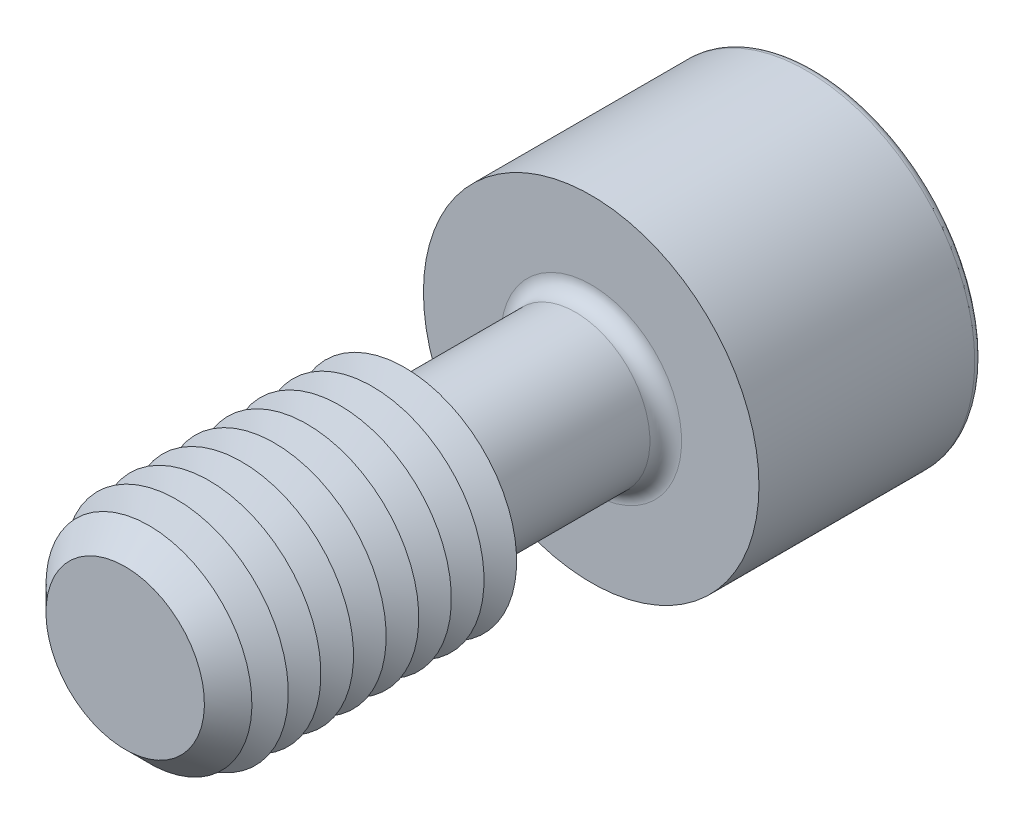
from build123d import *

# Parameters (mm, degrees)
SKETCH1_R       = 4
EXTRUDE1_DEPTH  = 12.5
CHAMFER1_SIZE   = 1.75
SKETCH3_R       = 9
EXTRUDE2_DEPTH  = 12
EXTRUDE3_DEPTH  = 10
FILLET1_R       = 0.85
FILLET2_R       = 0.425
LPATTERN1_COUNT = 8
LPATTERN1_PITCH = 1.75


with BuildPart() as part:
    # Sketch1 → Extrude1 (new, symmetric)
    with BuildSketch(Plane.XY):
        Circle(SKETCH1_R)
    extrude(amount=EXTRUDE1_DEPTH, both=True)

    # Sketch2 → Revolve1 (revolve)
    with BuildSketch(Plane(origin=(0, 0, 0), x_dir=(0, 0, -1), z_dir=(1, 0, 0))):
        Polygon((-12.5, 0), (-12.5, 6), (2.5, 6), (3.654700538, 4), (3.654700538, 0), align=None)
    revolve(axis=Axis((0, 0, -3.654700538), (0, 0, 1)))

    # Chamfer1
    chamfer1_edges = [part.edges().sort_by_distance(p)[0] for p in [
        (0, -6, 12.5),
    ]]
    chamfer(chamfer1_edges, length=CHAMFER1_SIZE)

    # Sketch3 → Extrude2 (add)
    with BuildSketch(Plane(origin=(0, 0, -12.5), x_dir=(-1, 0, 0), z_dir=(0, 0, -1))):
        Circle(SKETCH3_R)
    extrude(amount=EXTRUDE2_DEPTH)

    # Sketch4 → Extrude3 (cut)
    with BuildSketch(Plane(origin=(-13.7, 0, -24.5), x_dir=(1, 0, 0), z_dir=(0, 0, 1))):
        Polygon((10.813248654, -5), (16.586751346, -5), (19.473502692, 0), (16.586751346, 5), (10.813248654, 5), (7.926497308, 0), align=None)
    extrude(amount=EXTRUDE3_DEPTH, mode=Mode.SUBTRACT)

    # Fillet1
    fillet1_edges = [part.edges().sort_by_distance(p)[0] for p in [
        (-4, 0, -12.5),
    ]]
    fillet(fillet1_edges, radius=FILLET1_R)

    # Fillet2
    fillet2_edges = [part.edges().sort_by_distance(p)[0] for p in [
        (9, 0, -24.5),
    ]]
    fillet(fillet2_edges, radius=FILLET2_R)

    # Sketch5 → Cut-Revolve1 (revolve, cut)
    with BuildSketch(Plane(origin=(0, 0, 0), x_dir=(0, 0, -1), z_dir=(1, 0, 0)), mode=Mode.PRIVATE) as cut_revolve1_sk:
        Polygon((14.5, 0), (14.5, -5), (11.613248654, 0), align=None)
    revolve(cut_revolve1_sk.sketch.rotate(Axis((0, 0, -11.613248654), (0, 0, -1)), 90), axis=Axis((0, 0, -11.613248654), (0, 0, -1)), mode=Mode.SUBTRACT)

    # Sketch7 → Cut-Revolve2 (revolve, cut)
    with BuildSketch(Plane(origin=(0, 0, 0), x_dir=(0, 0, -1), z_dir=(1, 0, 0)), mode=Mode.PRIVATE) as cut_revolve2_sk:
        Polygon((2.5, 6), (1.625, 4.484455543), (0.75, 6), align=None)
    cut_revolve2 = revolve(cut_revolve2_sk.sketch.rotate(Axis((0, 0, -1.332048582), (0, 0, 1)), 90), axis=Axis((0, 0, -1.332048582), (0, 0, 1)), mode=Mode.SUBTRACT)

    # LPattern1: Cut-Revolve2 ×8
    with Locations(*[(0, 0, i * LPATTERN1_PITCH) for i in range(1, LPATTERN1_COUNT)]):
        add(cut_revolve2, mode=Mode.SUBTRACT)


solid = part.part
